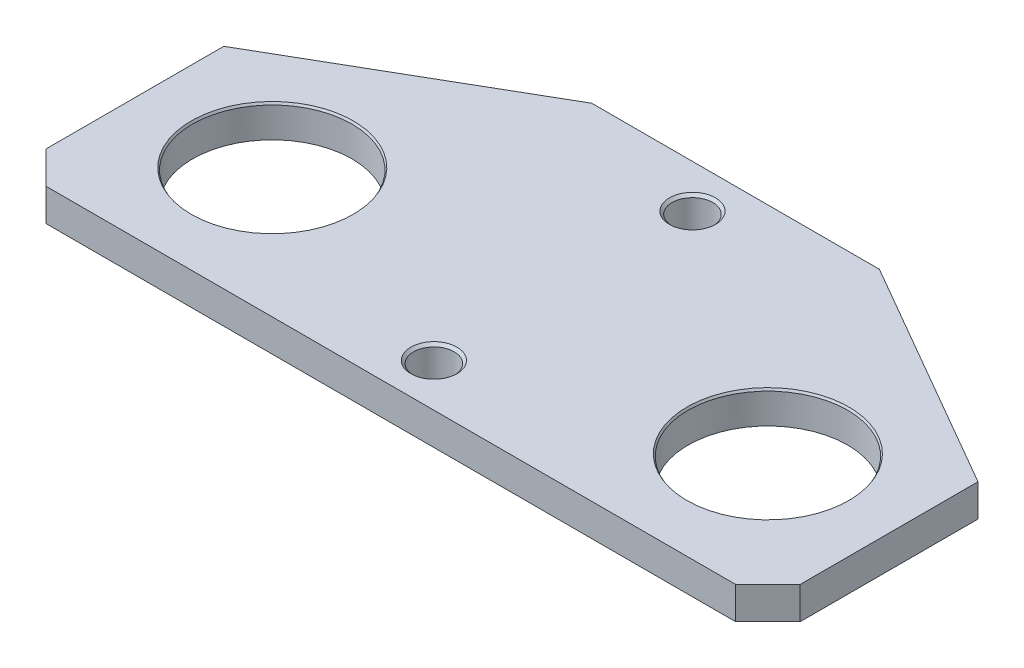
ISO-10303-21;
HEADER;
FILE_DESCRIPTION(('STEP AP214'),'2;1');
FILE_NAME('part.step','',(''),(''),'','','');
FILE_SCHEMA(('AUTOMOTIVE_DESIGN { 1 0 10303 214 1 1 1 1 }'));
ENDSEC;
DATA;
#1=APPLICATION_CONTEXT('core data for automotive mechanical design processes');
#2=APPLICATION_PROTOCOL_DEFINITION('international standard','automotive_design',2000,#1);
#3=PRODUCT_CONTEXT('',#1,'mechanical');
#4=PRODUCT('Part','Part','',(#3));
#5=PRODUCT_RELATED_PRODUCT_CATEGORY('part','',(#4));
#6=PRODUCT_DEFINITION_FORMATION('','',#4);
#7=PRODUCT_DEFINITION_CONTEXT('part definition',#1,'design');
#8=PRODUCT_DEFINITION('design','',#6,#7);
#9=PRODUCT_DEFINITION_SHAPE('','',#8);
#10=(LENGTH_UNIT() NAMED_UNIT(*) SI_UNIT(.MILLI.,.METRE.));
#11=(NAMED_UNIT(*) PLANE_ANGLE_UNIT() SI_UNIT($,.RADIAN.));
#12=(NAMED_UNIT(*) SI_UNIT($,.STERADIAN.) SOLID_ANGLE_UNIT());
#13=UNCERTAINTY_MEASURE_WITH_UNIT(LENGTH_MEASURE(1.E-05),#10,'distance_accuracy_value','');
#14=(GEOMETRIC_REPRESENTATION_CONTEXT(3) GLOBAL_UNCERTAINTY_ASSIGNED_CONTEXT((#13)) GLOBAL_UNIT_ASSIGNED_CONTEXT((#10,
#11,#12)) REPRESENTATION_CONTEXT('',''));
#15=CARTESIAN_POINT('',(0.,0.,0.));
#16=DIRECTION('',(0.,0.,1.));
#17=DIRECTION('',(1.,0.,0.));
#18=AXIS2_PLACEMENT_3D('',#15,#16,#17);
#19=CARTESIAN_POINT('',(0.,4.7625,0.));
#20=DIRECTION('',(0.,1.,0.));
#21=DIRECTION('',(0.,0.,1.));
#22=AXIS2_PLACEMENT_3D('',#19,#20,#21);
#23=PLANE('',#22);
#24=CARTESIAN_POINT('',(0.,4.7625,76.2));
#25=DIRECTION('',(0.,1.,0.));
#26=DIRECTION('',(0.,0.,1.));
#27=AXIS2_PLACEMENT_3D('',#24,#25,#26);
#28=CIRCLE('',#27,6.79375000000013);
#29=CARTESIAN_POINT('',(0.,4.7625,82.9937500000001));
#30=VERTEX_POINT('',#29);
#31=EDGE_CURVE('E41',#30,#30,#28,.F.);
#32=ORIENTED_EDGE('',*,*,#31,.T.);
#33=EDGE_LOOP('',(#32));
#34=FACE_BOUND('',#33,.T.);
#35=CARTESIAN_POINT('',(0.,4.7625,0.));
#36=DIRECTION('',(0.,1.,0.));
#37=DIRECTION('',(0.,0.,1.));
#38=AXIS2_PLACEMENT_3D('',#35,#36,#37);
#39=CIRCLE('',#38,6.7937500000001);
#40=CARTESIAN_POINT('',(0.,4.7625,6.7937500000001));
#41=VERTEX_POINT('',#40);
#42=EDGE_CURVE('E176',#41,#41,#39,.F.);
#43=ORIENTED_EDGE('',*,*,#42,.T.);
#44=EDGE_LOOP('',(#43));
#45=FACE_BOUND('',#44,.T.);
#46=CARTESIAN_POINT('',(73.025,4.7625,50.8));
#47=DIRECTION('',(0.,1.,0.));
#48=DIRECTION('',(0.,0.,1.));
#49=AXIS2_PLACEMENT_3D('',#46,#47,#48);
#50=CIRCLE('',#49,23.8666174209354);
#51=CARTESIAN_POINT('',(73.025,4.7625,74.6666174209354));
#52=VERTEX_POINT('',#51);
#53=EDGE_CURVE('E152',#52,#52,#50,.F.);
#54=ORIENTED_EDGE('',*,*,#53,.T.);
#55=EDGE_LOOP('',(#54));
#56=FACE_BOUND('',#55,.T.);
#57=CARTESIAN_POINT('',(-73.025,4.7625,50.8));
#58=DIRECTION('',(0.,1.,0.));
#59=DIRECTION('',(0.,0.,1.));
#60=AXIS2_PLACEMENT_3D('',#57,#58,#59);
#61=CIRCLE('',#60,23.8666174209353);
#62=CARTESIAN_POINT('',(-73.025,4.7625,74.6666174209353));
#63=VERTEX_POINT('',#62);
#64=EDGE_CURVE('E149',#63,#63,#61,.F.);
#65=ORIENTED_EDGE('',*,*,#64,.T.);
#66=EDGE_LOOP('',(#65));
#67=FACE_BOUND('',#66,.T.);
#68=DIRECTION('',(-1.,0.,0.));
#69=VECTOR('',#68,1.);
#70=CARTESIAN_POINT('',(-111.125,4.7625,-12.7));
#71=LINE('',#70,#69);
#72=CARTESIAN_POINT('',(42.3842335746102,4.7625,-12.7));
#73=VERTEX_POINT('',#72);
#74=CARTESIAN_POINT('',(-42.3842335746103,4.7625,-12.7));
#75=VERTEX_POINT('',#74);
#76=EDGE_CURVE('E118',#73,#75,#71,.T.);
#77=ORIENTED_EDGE('',*,*,#76,.T.);
#78=DIRECTION('',(0.866025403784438,0.,-0.500000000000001));
#79=VECTOR('',#78,1.);
#80=CARTESIAN_POINT('',(-16.0953197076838,4.7625,-27.8779114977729));
#81=LINE('',#80,#79);
#82=CARTESIAN_POINT('',(-111.125,4.7625,26.9875));
#83=VERTEX_POINT('',#82);
#84=EDGE_CURVE('E170',#75,#83,#81,.F.);
#85=ORIENTED_EDGE('',*,*,#84,.T.);
#86=DIRECTION('',(0.,0.,1.));
#87=VECTOR('',#86,1.);
#88=CARTESIAN_POINT('',(-111.125,4.7625,-12.7));
#89=LINE('',#88,#87);
#90=CARTESIAN_POINT('',(-111.125,4.7625,79.375));
#91=VERTEX_POINT('',#90);
#92=EDGE_CURVE('E128',#83,#91,#89,.T.);
#93=ORIENTED_EDGE('',*,*,#92,.T.);
#94=DIRECTION('',(-0.707106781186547,0.,-0.707106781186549));
#95=VECTOR('',#94,1.);
#96=CARTESIAN_POINT('',(-95.2500000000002,4.7625,95.2499999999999));
#97=LINE('',#96,#95);
#98=CARTESIAN_POINT('',(-101.6,4.7625,88.9));
#99=VERTEX_POINT('',#98);
#100=EDGE_CURVE('E139',#91,#99,#97,.F.);
#101=ORIENTED_EDGE('',*,*,#100,.T.);
#102=DIRECTION('',(1.,0.,0.));
#103=VECTOR('',#102,1.);
#104=CARTESIAN_POINT('',(-111.125,4.7625,88.9));
#105=LINE('',#104,#103);
#106=CARTESIAN_POINT('',(101.6,4.7625,88.9));
#107=VERTEX_POINT('',#106);
#108=EDGE_CURVE('E210',#99,#107,#105,.T.);
#109=ORIENTED_EDGE('',*,*,#108,.T.);
#110=DIRECTION('',(-0.707106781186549,0.,0.707106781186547));
#111=VECTOR('',#110,1.);
#112=CARTESIAN_POINT('',(95.2499999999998,4.7625,95.2500000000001));
#113=LINE('',#112,#111);
#114=CARTESIAN_POINT('',(111.125,4.7625,79.3749999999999));
#115=VERTEX_POINT('',#114);
#116=EDGE_CURVE('E141',#107,#115,#113,.F.);
#117=ORIENTED_EDGE('',*,*,#116,.T.);
#118=DIRECTION('',(0.,0.,-1.));
#119=VECTOR('',#118,1.);
#120=CARTESIAN_POINT('',(111.125,4.7625,-12.7));
#121=LINE('',#120,#119);
#122=CARTESIAN_POINT('',(111.125,4.7625,26.9875));
#123=VERTEX_POINT('',#122);
#124=EDGE_CURVE('E117',#115,#123,#121,.T.);
#125=ORIENTED_EDGE('',*,*,#124,.T.);
#126=DIRECTION('',(0.866025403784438,0.,0.500000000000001));
#127=VECTOR('',#126,1.);
#128=CARTESIAN_POINT('',(16.0953197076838,4.7625,-27.8779114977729));
#129=LINE('',#128,#127);
#130=EDGE_CURVE('E168',#123,#73,#129,.F.);
#131=ORIENTED_EDGE('',*,*,#130,.T.);
#132=EDGE_LOOP('',(#77,#85,#93,#101,#109,#117,#125,#131));
#133=FACE_BOUND('',#132,.T.);
#134=ADVANCED_FACE('F33',(#34,#45,#56,#67,#133),#23,.T.);
#135=CARTESIAN_POINT('',(0.,-4.7625,0.));
#136=DIRECTION('',(0.,1.,0.));
#137=DIRECTION('',(0.,0.,1.));
#138=AXIS2_PLACEMENT_3D('',#135,#136,#137);
#139=PLANE('',#138);
#140=CARTESIAN_POINT('',(0.,-4.7625,0.));
#141=DIRECTION('',(0.,1.,0.));
#142=DIRECTION('',(0.,0.,1.));
#143=AXIS2_PLACEMENT_3D('',#140,#141,#142);
#144=CIRCLE('',#143,6.);
#145=CARTESIAN_POINT('',(0.,-4.7625,-6.));
#146=VERTEX_POINT('',#145);
#147=EDGE_CURVE('E198',#146,#146,#144,.T.);
#148=ORIENTED_EDGE('',*,*,#147,.T.);
#149=EDGE_LOOP('',(#148));
#150=FACE_BOUND('',#149,.T.);
#151=CARTESIAN_POINT('',(-73.025,-4.7625,50.8));
#152=DIRECTION('',(0.,1.,0.));
#153=DIRECTION('',(0.,0.,1.));
#154=AXIS2_PLACEMENT_3D('',#151,#152,#153);
#155=CIRCLE('',#154,23.5);
#156=CARTESIAN_POINT('',(-73.025,-4.7625,27.3));
#157=VERTEX_POINT('',#156);
#158=EDGE_CURVE('E206',#157,#157,#155,.T.);
#159=ORIENTED_EDGE('',*,*,#158,.T.);
#160=EDGE_LOOP('',(#159));
#161=FACE_BOUND('',#160,.T.);
#162=DIRECTION('',(0.,0.,1.));
#163=VECTOR('',#162,1.);
#164=CARTESIAN_POINT('',(-111.125,-4.7625,-12.7));
#165=LINE('',#164,#163);
#166=CARTESIAN_POINT('',(-111.125,-4.7625,26.9875));
#167=VERTEX_POINT('',#166);
#168=CARTESIAN_POINT('',(-111.125,-4.7625,79.375));
#169=VERTEX_POINT('',#168);
#170=EDGE_CURVE('E130',#167,#169,#165,.T.);
#171=ORIENTED_EDGE('',*,*,#170,.F.);
#172=DIRECTION('',(-0.866025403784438,0.,0.500000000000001));
#173=VECTOR('',#172,1.);
#174=CARTESIAN_POINT('',(-111.125,-4.7625,26.9875));
#175=LINE('',#174,#173);
#176=CARTESIAN_POINT('',(-42.3842335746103,-4.7625,-12.7));
#177=VERTEX_POINT('',#176);
#178=EDGE_CURVE('E162',#167,#177,#175,.F.);
#179=ORIENTED_EDGE('',*,*,#178,.T.);
#180=DIRECTION('',(-1.,0.,0.));
#181=VECTOR('',#180,1.);
#182=CARTESIAN_POINT('',(-111.125,-4.7625,-12.7));
#183=LINE('',#182,#181);
#184=CARTESIAN_POINT('',(42.3842335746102,-4.7625,-12.7));
#185=VERTEX_POINT('',#184);
#186=EDGE_CURVE('E125',#185,#177,#183,.T.);
#187=ORIENTED_EDGE('',*,*,#186,.F.);
#188=DIRECTION('',(-0.866025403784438,0.,-0.500000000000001));
#189=VECTOR('',#188,1.);
#190=CARTESIAN_POINT('',(42.3842335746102,-4.7625,-12.7));
#191=LINE('',#190,#189);
#192=CARTESIAN_POINT('',(111.125,-4.7625,26.9875));
#193=VERTEX_POINT('',#192);
#194=EDGE_CURVE('E124',#185,#193,#191,.F.);
#195=ORIENTED_EDGE('',*,*,#194,.T.);
#196=DIRECTION('',(0.,0.,-1.));
#197=VECTOR('',#196,1.);
#198=CARTESIAN_POINT('',(111.125,-4.7625,-12.7));
#199=LINE('',#198,#197);
#200=CARTESIAN_POINT('',(111.125,-4.7625,79.3749999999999));
#201=VERTEX_POINT('',#200);
#202=EDGE_CURVE('E116',#201,#193,#199,.T.);
#203=ORIENTED_EDGE('',*,*,#202,.F.);
#204=DIRECTION('',(0.707106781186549,0.,-0.707106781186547));
#205=VECTOR('',#204,1.);
#206=CARTESIAN_POINT('',(111.125,-4.7625,79.375));
#207=LINE('',#206,#205);
#208=CARTESIAN_POINT('',(101.6,-4.7625,88.9));
#209=VERTEX_POINT('',#208);
#210=EDGE_CURVE('E102',#201,#209,#207,.F.);
#211=ORIENTED_EDGE('',*,*,#210,.T.);
#212=DIRECTION('',(1.,0.,0.));
#213=VECTOR('',#212,1.);
#214=CARTESIAN_POINT('',(-111.125,-4.7625,88.9));
#215=LINE('',#214,#213);
#216=CARTESIAN_POINT('',(-101.6,-4.7625,88.9));
#217=VERTEX_POINT('',#216);
#218=EDGE_CURVE('E126',#217,#209,#215,.T.);
#219=ORIENTED_EDGE('',*,*,#218,.F.);
#220=DIRECTION('',(0.707106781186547,0.,0.707106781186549));
#221=VECTOR('',#220,1.);
#222=CARTESIAN_POINT('',(-101.6,-4.7625,88.9));
#223=LINE('',#222,#221);
#224=EDGE_CURVE('E113',#217,#169,#223,.F.);
#225=ORIENTED_EDGE('',*,*,#224,.T.);
#226=EDGE_LOOP('',(#171,#179,#187,#195,#203,#211,#219,#225));
#227=FACE_BOUND('',#226,.T.);
#228=CARTESIAN_POINT('',(73.025,-4.7625,50.8));
#229=DIRECTION('',(0.,1.,0.));
#230=DIRECTION('',(0.,0.,1.));
#231=AXIS2_PLACEMENT_3D('',#228,#229,#230);
#232=CIRCLE('',#231,23.5);
#233=CARTESIAN_POINT('',(73.025,-4.7625,27.3));
#234=VERTEX_POINT('',#233);
#235=EDGE_CURVE('E201',#234,#234,#232,.T.);
#236=ORIENTED_EDGE('',*,*,#235,.T.);
#237=EDGE_LOOP('',(#236));
#238=FACE_BOUND('',#237,.T.);
#239=CARTESIAN_POINT('',(0.,-4.7625,76.2));
#240=DIRECTION('',(0.,1.,0.));
#241=DIRECTION('',(0.,0.,1.));
#242=AXIS2_PLACEMENT_3D('',#239,#240,#241);
#243=CIRCLE('',#242,6.00000000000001);
#244=CARTESIAN_POINT('',(0.,-4.7625,70.2));
#245=VERTEX_POINT('',#244);
#246=EDGE_CURVE('E196',#245,#245,#243,.T.);
#247=ORIENTED_EDGE('',*,*,#246,.T.);
#248=EDGE_LOOP('',(#247));
#249=FACE_BOUND('',#248,.T.);
#250=ADVANCED_FACE('F121',(#150,#161,#227,#238,#249),#139,.F.);
#251=CARTESIAN_POINT('',(-111.125,4.7625,-12.7));
#252=DIRECTION('',(1.,0.,0.));
#253=DIRECTION('',(0.,0.,-1.));
#254=AXIS2_PLACEMENT_3D('',#251,#252,#253);
#255=PLANE('',#254);
#256=ORIENTED_EDGE('',*,*,#92,.F.);
#257=DIRECTION('',(0.,-1.,0.));
#258=VECTOR('',#257,1.);
#259=CARTESIAN_POINT('',(-111.125,4.7625,26.9875));
#260=LINE('',#259,#258);
#261=EDGE_CURVE('E158',#83,#167,#260,.T.);
#262=ORIENTED_EDGE('',*,*,#261,.T.);
#263=ORIENTED_EDGE('',*,*,#170,.T.);
#264=DIRECTION('',(0.,1.,0.));
#265=VECTOR('',#264,1.);
#266=CARTESIAN_POINT('',(-111.125,4.7625,79.375));
#267=LINE('',#266,#265);
#268=EDGE_CURVE('E143',#169,#91,#267,.T.);
#269=ORIENTED_EDGE('',*,*,#268,.T.);
#270=EDGE_LOOP('',(#256,#262,#263,#269));
#271=FACE_BOUND('',#270,.T.);
#272=ADVANCED_FACE('F216',(#271),#255,.F.);
#273=CARTESIAN_POINT('',(-111.125,4.7625,88.9));
#274=DIRECTION('',(0.,0.,-1.));
#275=DIRECTION('',(-1.,0.,0.));
#276=AXIS2_PLACEMENT_3D('',#273,#274,#275);
#277=PLANE('',#276);
#278=ORIENTED_EDGE('',*,*,#218,.T.);
#279=DIRECTION('',(0.,1.,0.));
#280=VECTOR('',#279,1.);
#281=CARTESIAN_POINT('',(101.6,4.7625,88.9));
#282=LINE('',#281,#280);
#283=EDGE_CURVE('E107',#209,#107,#282,.T.);
#284=ORIENTED_EDGE('',*,*,#283,.T.);
#285=ORIENTED_EDGE('',*,*,#108,.F.);
#286=DIRECTION('',(0.,-1.,0.));
#287=VECTOR('',#286,1.);
#288=CARTESIAN_POINT('',(-101.6,4.7625,88.9));
#289=LINE('',#288,#287);
#290=EDGE_CURVE('E112',#99,#217,#289,.T.);
#291=ORIENTED_EDGE('',*,*,#290,.T.);
#292=EDGE_LOOP('',(#278,#284,#285,#291));
#293=FACE_BOUND('',#292,.T.);
#294=ADVANCED_FACE('F226',(#293),#277,.F.);
#295=CARTESIAN_POINT('',(111.125,4.7625,-12.7));
#296=DIRECTION('',(-1.,0.,0.));
#297=DIRECTION('',(0.,0.,1.));
#298=AXIS2_PLACEMENT_3D('',#295,#296,#297);
#299=PLANE('',#298);
#300=ORIENTED_EDGE('',*,*,#202,.T.);
#301=DIRECTION('',(0.,1.,0.));
#302=VECTOR('',#301,1.);
#303=CARTESIAN_POINT('',(111.125,4.7625,26.9875));
#304=LINE('',#303,#302);
#305=EDGE_CURVE('E48',#193,#123,#304,.T.);
#306=ORIENTED_EDGE('',*,*,#305,.T.);
#307=ORIENTED_EDGE('',*,*,#124,.F.);
#308=DIRECTION('',(0.,-1.,0.));
#309=VECTOR('',#308,1.);
#310=CARTESIAN_POINT('',(111.125,4.7625,79.375));
#311=LINE('',#310,#309);
#312=EDGE_CURVE('E106',#115,#201,#311,.T.);
#313=ORIENTED_EDGE('',*,*,#312,.T.);
#314=EDGE_LOOP('',(#300,#306,#307,#313));
#315=FACE_BOUND('',#314,.T.);
#316=ADVANCED_FACE('F115',(#315),#299,.F.);
#317=CARTESIAN_POINT('',(-111.125,4.7625,-12.7));
#318=DIRECTION('',(0.,0.,1.));
#319=DIRECTION('',(1.,0.,0.));
#320=AXIS2_PLACEMENT_3D('',#317,#318,#319);
#321=PLANE('',#320);
#322=ORIENTED_EDGE('',*,*,#186,.T.);
#323=DIRECTION('',(0.,1.,0.));
#324=VECTOR('',#323,1.);
#325=CARTESIAN_POINT('',(-42.3842335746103,4.7625,-12.7));
#326=LINE('',#325,#324);
#327=EDGE_CURVE('E56',#177,#75,#326,.T.);
#328=ORIENTED_EDGE('',*,*,#327,.T.);
#329=ORIENTED_EDGE('',*,*,#76,.F.);
#330=DIRECTION('',(0.,-1.,0.));
#331=VECTOR('',#330,1.);
#332=CARTESIAN_POINT('',(42.3842335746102,4.7625,-12.7));
#333=LINE('',#332,#331);
#334=EDGE_CURVE('E164',#73,#185,#333,.T.);
#335=ORIENTED_EDGE('',*,*,#334,.T.);
#336=EDGE_LOOP('',(#322,#328,#329,#335));
#337=FACE_BOUND('',#336,.T.);
#338=ADVANCED_FACE('F233',(#337),#321,.F.);
#339=CARTESIAN_POINT('',(-73.025,4.7625,50.8));
#340=DIRECTION('',(0.,-1.,0.));
#341=DIRECTION('',(0.,0.,-1.));
#342=AXIS2_PLACEMENT_3D('',#339,#340,#341);
#343=CYLINDRICAL_SURFACE('',#342,23.5);
#344=CARTESIAN_POINT('',(-73.025,4.12750000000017,50.8));
#345=DIRECTION('',(0.,1.,0.));
#346=DIRECTION('',(0.,0.,1.));
#347=AXIS2_PLACEMENT_3D('',#344,#345,#346);
#348=CIRCLE('',#347,23.5);
#349=CARTESIAN_POINT('',(-73.025,4.12750000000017,27.3));
#350=VERTEX_POINT('',#349);
#351=EDGE_CURVE('E155',#350,#350,#348,.T.);
#352=CARTESIAN_POINT('',(-73.025,4.12750000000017,27.3));
#353=CARTESIAN_POINT('',(-73.025,4.0348958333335,27.3));
#354=CARTESIAN_POINT('',(-73.025,3.94229166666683,27.3));
#355=CARTESIAN_POINT('',(-73.025,3.7570833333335,27.3));
#356=CARTESIAN_POINT('',(-73.025,3.66447916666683,27.3));
#357=CARTESIAN_POINT('',(-73.025,3.47927083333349,27.3));
#358=CARTESIAN_POINT('',(-73.025,3.38666666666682,27.3));
#359=CARTESIAN_POINT('',(-73.025,3.20145833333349,27.3));
#360=CARTESIAN_POINT('',(-73.025,3.10885416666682,27.3));
#361=CARTESIAN_POINT('',(-73.025,2.92364583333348,27.3));
#362=CARTESIAN_POINT('',(-73.025,2.83104166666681,27.3));
#363=CARTESIAN_POINT('',(-73.025,2.64583333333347,27.3));
#364=CARTESIAN_POINT('',(-73.025,2.55322916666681,27.3));
#365=CARTESIAN_POINT('',(-73.025,2.36802083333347,27.3));
#366=CARTESIAN_POINT('',(-73.025,2.2754166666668,27.3));
#367=CARTESIAN_POINT('',(-73.025,2.09020833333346,27.3));
#368=CARTESIAN_POINT('',(-73.025,1.9976041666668,27.3));
#369=CARTESIAN_POINT('',(-73.025,1.81239583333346,27.3));
#370=CARTESIAN_POINT('',(-73.025,1.71979166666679,27.3));
#371=CARTESIAN_POINT('',(-73.025,1.53458333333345,27.3));
#372=CARTESIAN_POINT('',(-73.025,1.44197916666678,27.3));
#373=CARTESIAN_POINT('',(-73.025,1.25677083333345,27.3));
#374=CARTESIAN_POINT('',(-73.025,1.16416666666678,27.3));
#375=CARTESIAN_POINT('',(-73.025,0.978958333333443,27.3));
#376=CARTESIAN_POINT('',(-73.025,0.886354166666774,27.3));
#377=CARTESIAN_POINT('',(-73.025,0.701145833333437,27.3));
#378=CARTESIAN_POINT('',(-73.025,0.608541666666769,27.3));
#379=CARTESIAN_POINT('',(-73.025,0.423333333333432,27.3));
#380=CARTESIAN_POINT('',(-73.025,0.330729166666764,27.3));
#381=CARTESIAN_POINT('',(-73.025,0.145520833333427,27.3));
#382=CARTESIAN_POINT('',(-73.025,0.0529166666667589,27.3));
#383=CARTESIAN_POINT('',(-73.025,-0.132291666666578,27.3));
#384=CARTESIAN_POINT('',(-73.025,-0.224895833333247,27.3));
#385=CARTESIAN_POINT('',(-73.025,-0.410104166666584,27.3));
#386=CARTESIAN_POINT('',(-73.025,-0.502708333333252,27.3));
#387=CARTESIAN_POINT('',(-73.025,-0.687916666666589,27.3));
#388=CARTESIAN_POINT('',(-73.025,-0.780520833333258,27.3));
#389=CARTESIAN_POINT('',(-73.025,-0.965729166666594,27.3));
#390=CARTESIAN_POINT('',(-73.025,-1.05833333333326,27.3));
#391=CARTESIAN_POINT('',(-73.025,-1.2435416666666,27.3));
#392=CARTESIAN_POINT('',(-73.025,-1.33614583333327,27.3));
#393=CARTESIAN_POINT('',(-73.025,-1.52135416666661,27.3));
#394=CARTESIAN_POINT('',(-73.025,-1.61395833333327,27.3));
#395=CARTESIAN_POINT('',(-73.025,-1.79916666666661,27.3));
#396=CARTESIAN_POINT('',(-73.025,-1.89177083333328,27.3));
#397=CARTESIAN_POINT('',(-73.025,-2.07697916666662,27.3));
#398=CARTESIAN_POINT('',(-73.025,-2.16958333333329,27.3));
#399=CARTESIAN_POINT('',(-73.025,-2.35479166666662,27.3));
#400=CARTESIAN_POINT('',(-73.025,-2.44739583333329,27.3));
#401=CARTESIAN_POINT('',(-73.025,-2.63260416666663,27.3));
#402=CARTESIAN_POINT('',(-73.025,-2.7252083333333,27.3));
#403=CARTESIAN_POINT('',(-73.025,-2.91041666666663,27.3));
#404=CARTESIAN_POINT('',(-73.025,-3.0030208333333,27.3));
#405=CARTESIAN_POINT('',(-73.025,-3.18822916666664,27.3));
#406=CARTESIAN_POINT('',(-73.025,-3.28083333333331,27.3));
#407=CARTESIAN_POINT('',(-73.025,-3.46604166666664,27.3));
#408=CARTESIAN_POINT('',(-73.025,-3.55864583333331,27.3));
#409=CARTESIAN_POINT('',(-73.025,-3.74385416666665,27.3));
#410=CARTESIAN_POINT('',(-73.025,-3.83645833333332,27.3));
#411=CARTESIAN_POINT('',(-73.025,-4.02166666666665,27.3));
#412=CARTESIAN_POINT('',(-73.025,-4.11427083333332,27.3));
#413=CARTESIAN_POINT('',(-73.025,-4.29947916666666,27.3));
#414=CARTESIAN_POINT('',(-73.025,-4.39208333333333,27.3));
#415=CARTESIAN_POINT('',(-73.025,-4.57729166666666,27.3));
#416=CARTESIAN_POINT('',(-73.025,-4.66989583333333,27.3));
#417=CARTESIAN_POINT('',(-73.025,-4.7625,27.3));
#418=B_SPLINE_CURVE_WITH_KNOTS('',3,(#352,#353,#354,#355,#356,#357,#358,#359,#360,#361,#362,
#363,#364,#365,#366,#367,#368,#369,#370,#371,#372,#373,#374,#375,#376,#377,#378,#379,#380,#381,
#382,#383,#384,#385,#386,#387,#388,#389,#390,#391,#392,#393,#394,#395,#396,#397,#398,#399,#400,
#401,#402,#403,#404,#405,#406,#407,#408,#409,#410,#411,#412,#413,#414,#415,#416,#417),
.UNSPECIFIED.,.F.,.F.,(4,2,2,2,2,2,2,2,2,2,2,2,2,2,2,2,2,2,2,2,2,2,2,2,2,2,2,2,2,2,2,2,4),(0.,
0.277812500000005,0.555625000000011,0.833437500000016,1.11125000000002,1.38906250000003,
1.66687500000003,1.94468750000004,2.22250000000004,2.50031250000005,2.77812500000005,
3.05593750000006,3.33375000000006,3.61156250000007,3.88937500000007,4.16718750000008,
4.44500000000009,4.72281250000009,5.0006250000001,5.2784375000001,5.55625000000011,
5.83406250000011,6.11187500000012,6.38968750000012,6.66750000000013,6.94531250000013,
7.22312500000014,7.50093750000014,7.77875000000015,8.05656250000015,8.33437500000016,
8.61218750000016,8.89000000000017),.UNSPECIFIED.);
#419=EDGE_CURVE('BSEAM244',#350,#157,#418,.T.);
#420=ORIENTED_EDGE('',*,*,#351,.T.);
#421=ORIENTED_EDGE('',*,*,#158,.F.);
#422=ORIENTED_EDGE('',*,*,#419,.T.);
#423=ORIENTED_EDGE('',*,*,#419,.F.);
#424=EDGE_LOOP('',(#420,#422,#421,#423));
#425=FACE_BOUND('',#424,.T.);
#426=ADVANCED_FACE('F244',(#425),#343,.F.);
#427=CARTESIAN_POINT('',(73.025,4.7625,50.8));
#428=DIRECTION('',(0.,-1.,0.));
#429=DIRECTION('',(0.,0.,-1.));
#430=AXIS2_PLACEMENT_3D('',#427,#428,#429);
#431=CYLINDRICAL_SURFACE('',#430,23.5);
#432=CARTESIAN_POINT('',(73.025,4.12750000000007,50.8));
#433=DIRECTION('',(0.,1.,0.));
#434=DIRECTION('',(0.,0.,1.));
#435=AXIS2_PLACEMENT_3D('',#432,#433,#434);
#436=CIRCLE('',#435,23.5);
#437=CARTESIAN_POINT('',(73.025,4.12750000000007,27.3));
#438=VERTEX_POINT('',#437);
#439=EDGE_CURVE('E146',#438,#438,#436,.T.);
#440=CARTESIAN_POINT('',(73.025,4.12750000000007,27.3));
#441=CARTESIAN_POINT('',(73.025,4.0348958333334,27.3));
#442=CARTESIAN_POINT('',(73.025,3.94229166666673,27.3));
#443=CARTESIAN_POINT('',(73.025,3.7570833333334,27.3));
#444=CARTESIAN_POINT('',(73.025,3.66447916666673,27.3));
#445=CARTESIAN_POINT('',(73.025,3.47927083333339,27.3));
#446=CARTESIAN_POINT('',(73.025,3.38666666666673,27.3));
#447=CARTESIAN_POINT('',(73.025,3.20145833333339,27.3));
#448=CARTESIAN_POINT('',(73.025,3.10885416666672,27.3));
#449=CARTESIAN_POINT('',(73.025,2.92364583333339,27.3));
#450=CARTESIAN_POINT('',(73.025,2.83104166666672,27.3));
#451=CARTESIAN_POINT('',(73.025,2.64583333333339,27.3));
#452=CARTESIAN_POINT('',(73.025,2.55322916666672,27.3));
#453=CARTESIAN_POINT('',(73.025,2.36802083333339,27.3));
#454=CARTESIAN_POINT('',(73.025,2.27541666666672,27.3));
#455=CARTESIAN_POINT('',(73.025,2.09020833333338,27.3));
#456=CARTESIAN_POINT('',(73.025,1.99760416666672,27.3));
#457=CARTESIAN_POINT('',(73.025,1.81239583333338,27.3));
#458=CARTESIAN_POINT('',(73.025,1.71979166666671,27.3));
#459=CARTESIAN_POINT('',(73.025,1.53458333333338,27.3));
#460=CARTESIAN_POINT('',(73.025,1.44197916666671,27.3));
#461=CARTESIAN_POINT('',(73.025,1.25677083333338,27.3));
#462=CARTESIAN_POINT('',(73.025,1.16416666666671,27.3));
#463=CARTESIAN_POINT('',(73.025,0.978958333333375,27.3));
#464=CARTESIAN_POINT('',(73.025,0.886354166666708,27.3));
#465=CARTESIAN_POINT('',(73.025,0.701145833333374,27.3));
#466=CARTESIAN_POINT('',(73.025,0.608541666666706,27.3));
#467=CARTESIAN_POINT('',(73.025,0.423333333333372,27.3));
#468=CARTESIAN_POINT('',(73.025,0.330729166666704,27.3));
#469=CARTESIAN_POINT('',(73.025,0.14552083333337,27.3));
#470=CARTESIAN_POINT('',(73.025,0.0529166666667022,27.3));
#471=CARTESIAN_POINT('',(73.025,-0.132291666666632,27.3));
#472=CARTESIAN_POINT('',(73.025,-0.2248958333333,27.3));
#473=CARTESIAN_POINT('',(73.025,-0.410104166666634,27.3));
#474=CARTESIAN_POINT('',(73.025,-0.502708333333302,27.3));
#475=CARTESIAN_POINT('',(73.025,-0.687916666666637,27.3));
#476=CARTESIAN_POINT('',(73.025,-0.780520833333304,27.3));
#477=CARTESIAN_POINT('',(73.025,-0.965729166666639,27.3));
#478=CARTESIAN_POINT('',(73.025,-1.05833333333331,27.3));
#479=CARTESIAN_POINT('',(73.025,-1.24354166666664,27.3));
#480=CARTESIAN_POINT('',(73.025,-1.33614583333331,27.3));
#481=CARTESIAN_POINT('',(73.025,-1.52135416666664,27.3));
#482=CARTESIAN_POINT('',(73.025,-1.61395833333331,27.3));
#483=CARTESIAN_POINT('',(73.025,-1.79916666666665,27.3));
#484=CARTESIAN_POINT('',(73.025,-1.89177083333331,27.3));
#485=CARTESIAN_POINT('',(73.025,-2.07697916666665,27.3));
#486=CARTESIAN_POINT('',(73.025,-2.16958333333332,27.3));
#487=CARTESIAN_POINT('',(73.025,-2.35479166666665,27.3));
#488=CARTESIAN_POINT('',(73.025,-2.44739583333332,27.3));
#489=CARTESIAN_POINT('',(73.025,-2.63260416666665,27.3));
#490=CARTESIAN_POINT('',(73.025,-2.72520833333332,27.3));
#491=CARTESIAN_POINT('',(73.025,-2.91041666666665,27.3));
#492=CARTESIAN_POINT('',(73.025,-3.00302083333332,27.3));
#493=CARTESIAN_POINT('',(73.025,-3.18822916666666,27.3));
#494=CARTESIAN_POINT('',(73.025,-3.28083333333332,27.3));
#495=CARTESIAN_POINT('',(73.025,-3.46604166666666,27.3));
#496=CARTESIAN_POINT('',(73.025,-3.55864583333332,27.3));
#497=CARTESIAN_POINT('',(73.025,-3.74385416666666,27.3));
#498=CARTESIAN_POINT('',(73.025,-3.83645833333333,27.3));
#499=CARTESIAN_POINT('',(73.025,-4.02166666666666,27.3));
#500=CARTESIAN_POINT('',(73.025,-4.11427083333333,27.3));
#501=CARTESIAN_POINT('',(73.025,-4.29947916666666,27.3));
#502=CARTESIAN_POINT('',(73.025,-4.39208333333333,27.3));
#503=CARTESIAN_POINT('',(73.025,-4.57729166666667,27.3));
#504=CARTESIAN_POINT('',(73.025,-4.66989583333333,27.3));
#505=CARTESIAN_POINT('',(73.025,-4.7625,27.3));
#506=B_SPLINE_CURVE_WITH_KNOTS('',3,(#440,#441,#442,#443,#444,#445,#446,#447,#448,#449,#450,
#451,#452,#453,#454,#455,#456,#457,#458,#459,#460,#461,#462,#463,#464,#465,#466,#467,#468,#469,
#470,#471,#472,#473,#474,#475,#476,#477,#478,#479,#480,#481,#482,#483,#484,#485,#486,#487,#488,
#489,#490,#491,#492,#493,#494,#495,#496,#497,#498,#499,#500,#501,#502,#503,#504,#505),
.UNSPECIFIED.,.F.,.F.,(4,2,2,2,2,2,2,2,2,2,2,2,2,2,2,2,2,2,2,2,2,2,2,2,2,2,2,2,2,2,2,2,4),(0.,
0.277812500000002,0.555625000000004,0.833437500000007,1.11125000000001,1.38906250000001,
1.66687500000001,1.94468750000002,2.22250000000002,2.50031250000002,2.77812500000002,
3.05593750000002,3.33375000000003,3.61156250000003,3.88937500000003,4.16718750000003,
4.44500000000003,4.72281250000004,5.00062500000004,5.27843750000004,5.55625000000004,
5.83406250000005,6.11187500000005,6.38968750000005,6.66750000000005,6.94531250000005,
7.22312500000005,7.50093750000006,7.77875000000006,8.05656250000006,8.33437500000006,
8.61218750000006,8.89000000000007),.UNSPECIFIED.);
#507=EDGE_CURVE('BSEAM251',#438,#234,#506,.T.);
#508=ORIENTED_EDGE('',*,*,#439,.T.);
#509=ORIENTED_EDGE('',*,*,#235,.F.);
#510=ORIENTED_EDGE('',*,*,#507,.T.);
#511=ORIENTED_EDGE('',*,*,#507,.F.);
#512=EDGE_LOOP('',(#508,#510,#509,#511));
#513=FACE_BOUND('',#512,.T.);
#514=ADVANCED_FACE('F251',(#513),#431,.F.);
#515=CARTESIAN_POINT('',(0.,4.7625,0.));
#516=DIRECTION('',(0.,-1.,0.));
#517=DIRECTION('',(0.,0.,-1.));
#518=AXIS2_PLACEMENT_3D('',#515,#516,#517);
#519=CYLINDRICAL_SURFACE('',#518,6.);
#520=CARTESIAN_POINT('',(0.,3.96874999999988,0.));
#521=DIRECTION('',(0.,1.,0.));
#522=DIRECTION('',(0.,0.,1.));
#523=AXIS2_PLACEMENT_3D('',#520,#521,#522);
#524=CIRCLE('',#523,6.);
#525=CARTESIAN_POINT('',(0.,3.96874999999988,-6.));
#526=VERTEX_POINT('',#525);
#527=EDGE_CURVE('E11',#526,#526,#524,.T.);
#528=CARTESIAN_POINT('',(0.,3.96874999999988,-6.));
#529=CARTESIAN_POINT('',(0.,3.87779947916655,-6.));
#530=CARTESIAN_POINT('',(0.,3.78684895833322,-6.));
#531=CARTESIAN_POINT('',(0.,3.60494791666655,-6.));
#532=CARTESIAN_POINT('',(0.,3.51399739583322,-6.));
#533=CARTESIAN_POINT('',(0.,3.33209635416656,-6.));
#534=CARTESIAN_POINT('',(0.,3.24114583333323,-6.));
#535=CARTESIAN_POINT('',(0.,3.05924479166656,-6.));
#536=CARTESIAN_POINT('',(0.,2.96829427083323,-6.));
#537=CARTESIAN_POINT('',(0.,2.78639322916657,-6.));
#538=CARTESIAN_POINT('',(0.,2.69544270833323,-6.));
#539=CARTESIAN_POINT('',(0.,2.51354166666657,-6.));
#540=CARTESIAN_POINT('',(0.,2.42259114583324,-6.));
#541=CARTESIAN_POINT('',(0.,2.24069010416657,-6.));
#542=CARTESIAN_POINT('',(0.,2.14973958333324,-6.));
#543=CARTESIAN_POINT('',(0.,1.96783854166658,-6.));
#544=CARTESIAN_POINT('',(0.,1.87688802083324,-6.));
#545=CARTESIAN_POINT('',(0.,1.69498697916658,-6.));
#546=CARTESIAN_POINT('',(0.,1.60403645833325,-6.));
#547=CARTESIAN_POINT('',(0.,1.42213541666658,-6.));
#548=CARTESIAN_POINT('',(0.,1.33118489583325,-6.));
#549=CARTESIAN_POINT('',(0.,1.14928385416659,-6.));
#550=CARTESIAN_POINT('',(0.,1.05833333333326,-6.));
#551=CARTESIAN_POINT('',(0.,0.876432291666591,-6.));
#552=CARTESIAN_POINT('',(0.,0.785481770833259,-6.));
#553=CARTESIAN_POINT('',(0.,0.603580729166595,-6.));
#554=CARTESIAN_POINT('',(0.,0.512630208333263,-6.));
#555=CARTESIAN_POINT('',(0.,0.330729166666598,-6.));
#556=CARTESIAN_POINT('',(0.,0.239778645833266,-6.));
#557=CARTESIAN_POINT('',(0.,0.057877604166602,-6.));
#558=CARTESIAN_POINT('',(0.,-0.0330729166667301,-6.));
#559=CARTESIAN_POINT('',(0.,-0.214973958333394,-6.));
#560=CARTESIAN_POINT('',(0.,-0.305924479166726,-6.));
#561=CARTESIAN_POINT('',(0.,-0.487825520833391,-6.));
#562=CARTESIAN_POINT('',(0.,-0.578776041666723,-6.));
#563=CARTESIAN_POINT('',(0.,-0.760677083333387,-6.));
#564=CARTESIAN_POINT('',(0.,-0.851627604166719,-6.));
#565=CARTESIAN_POINT('',(0.,-1.03352864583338,-6.));
#566=CARTESIAN_POINT('',(0.,-1.12447916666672,-6.));
#567=CARTESIAN_POINT('',(0.,-1.30638020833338,-6.));
#568=CARTESIAN_POINT('',(0.,-1.39733072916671,-6.));
#569=CARTESIAN_POINT('',(0.,-1.57923177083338,-6.));
#570=CARTESIAN_POINT('',(0.,-1.67018229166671,-6.));
#571=CARTESIAN_POINT('',(0.,-1.85208333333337,-6.));
#572=CARTESIAN_POINT('',(0.,-1.9430338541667,-6.));
#573=CARTESIAN_POINT('',(0.,-2.12493489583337,-6.));
#574=CARTESIAN_POINT('',(0.,-2.2158854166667,-6.));
#575=CARTESIAN_POINT('',(0.,-2.39778645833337,-6.));
#576=CARTESIAN_POINT('',(0.,-2.4887369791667,-6.));
#577=CARTESIAN_POINT('',(0.,-2.67063802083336,-6.));
#578=CARTESIAN_POINT('',(0.,-2.76158854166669,-6.));
#579=CARTESIAN_POINT('',(0.,-2.94348958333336,-6.));
#580=CARTESIAN_POINT('',(0.,-3.03444010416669,-6.));
#581=CARTESIAN_POINT('',(0.,-3.21634114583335,-6.));
#582=CARTESIAN_POINT('',(0.,-3.30729166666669,-6.));
#583=CARTESIAN_POINT('',(0.,-3.48919270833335,-6.));
#584=CARTESIAN_POINT('',(0.,-3.58014322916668,-6.));
#585=CARTESIAN_POINT('',(0.,-3.76204427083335,-6.));
#586=CARTESIAN_POINT('',(0.,-3.85299479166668,-6.));
#587=CARTESIAN_POINT('',(0.,-4.03489583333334,-6.));
#588=CARTESIAN_POINT('',(0.,-4.12584635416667,-6.));
#589=CARTESIAN_POINT('',(0.,-4.30774739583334,-6.));
#590=CARTESIAN_POINT('',(0.,-4.39869791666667,-6.));
#591=CARTESIAN_POINT('',(0.,-4.58059895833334,-6.));
#592=CARTESIAN_POINT('',(0.,-4.67154947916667,-6.));
#593=CARTESIAN_POINT('',(0.,-4.7625,-6.));
#594=B_SPLINE_CURVE_WITH_KNOTS('',3,(#528,#529,#530,#531,#532,#533,#534,#535,#536,#537,#538,
#539,#540,#541,#542,#543,#544,#545,#546,#547,#548,#549,#550,#551,#552,#553,#554,#555,#556,#557,
#558,#559,#560,#561,#562,#563,#564,#565,#566,#567,#568,#569,#570,#571,#572,#573,#574,#575,#576,
#577,#578,#579,#580,#581,#582,#583,#584,#585,#586,#587,#588,#589,#590,#591,#592,#593),
.UNSPECIFIED.,.F.,.F.,(4,2,2,2,2,2,2,2,2,2,2,2,2,2,2,2,2,2,2,2,2,2,2,2,2,2,2,2,2,2,2,2,4),(0.,
0.272851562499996,0.545703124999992,0.818554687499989,1.09140624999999,1.36425781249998,
1.63710937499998,1.90996093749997,2.18281249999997,2.45566406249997,2.72851562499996,
3.00136718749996,3.27421874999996,3.54707031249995,3.81992187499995,4.09277343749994,
4.36562499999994,4.63847656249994,4.91132812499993,5.18417968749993,5.45703124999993,
5.72988281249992,6.00273437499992,6.27558593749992,6.54843749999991,6.82128906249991,
7.0941406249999,7.3669921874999,7.6398437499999,7.91269531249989,8.18554687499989,
8.45839843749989,8.73124999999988),.UNSPECIFIED.);
#595=EDGE_CURVE('BSEAM192',#526,#146,#594,.T.);
#596=ORIENTED_EDGE('',*,*,#527,.T.);
#597=ORIENTED_EDGE('',*,*,#147,.F.);
#598=ORIENTED_EDGE('',*,*,#595,.T.);
#599=ORIENTED_EDGE('',*,*,#595,.F.);
#600=EDGE_LOOP('',(#596,#598,#597,#599));
#601=FACE_BOUND('',#600,.T.);
#602=ADVANCED_FACE('F192',(#601),#519,.F.);
#603=CARTESIAN_POINT('',(0.,4.7625,76.2));
#604=DIRECTION('',(0.,-1.,0.));
#605=DIRECTION('',(0.,0.,-1.));
#606=AXIS2_PLACEMENT_3D('',#603,#604,#605);
#607=CYLINDRICAL_SURFACE('',#606,6.00000000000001);
#608=CARTESIAN_POINT('',(0.,3.96874999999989,76.2));
#609=DIRECTION('',(0.,1.,0.));
#610=DIRECTION('',(0.,0.,1.));
#611=AXIS2_PLACEMENT_3D('',#608,#609,#610);
#612=CIRCLE('',#611,6.00000000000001);
#613=CARTESIAN_POINT('',(0.,3.96874999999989,70.2));
#614=VERTEX_POINT('',#613);
#615=EDGE_CURVE('E173',#614,#614,#612,.T.);
#616=CARTESIAN_POINT('',(0.,3.96874999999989,70.2));
#617=CARTESIAN_POINT('',(0.,3.87779947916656,70.2));
#618=CARTESIAN_POINT('',(0.,3.78684895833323,70.2));
#619=CARTESIAN_POINT('',(0.,3.60494791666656,70.2));
#620=CARTESIAN_POINT('',(0.,3.51399739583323,70.2));
#621=CARTESIAN_POINT('',(0.,3.33209635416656,70.2));
#622=CARTESIAN_POINT('',(0.,3.24114583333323,70.2));
#623=CARTESIAN_POINT('',(0.,3.05924479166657,70.2));
#624=CARTESIAN_POINT('',(0.,2.96829427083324,70.2));
#625=CARTESIAN_POINT('',(0.,2.78639322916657,70.2));
#626=CARTESIAN_POINT('',(0.,2.69544270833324,70.2));
#627=CARTESIAN_POINT('',(0.,2.51354166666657,70.2));
#628=CARTESIAN_POINT('',(0.,2.42259114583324,70.2));
#629=CARTESIAN_POINT('',(0.,2.24069010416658,70.2));
#630=CARTESIAN_POINT('',(0.,2.14973958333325,70.2));
#631=CARTESIAN_POINT('',(0.,1.96783854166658,70.2));
#632=CARTESIAN_POINT('',(0.,1.87688802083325,70.2));
#633=CARTESIAN_POINT('',(0.,1.69498697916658,70.2));
#634=CARTESIAN_POINT('',(0.,1.60403645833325,70.2));
#635=CARTESIAN_POINT('',(0.,1.42213541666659,70.2));
#636=CARTESIAN_POINT('',(0.,1.33118489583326,70.2));
#637=CARTESIAN_POINT('',(0.,1.14928385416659,70.2));
#638=CARTESIAN_POINT('',(0.,1.05833333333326,70.2));
#639=CARTESIAN_POINT('',(0.,0.876432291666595,70.2));
#640=CARTESIAN_POINT('',(0.,0.785481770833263,70.2));
#641=CARTESIAN_POINT('',(0.,0.603580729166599,70.2));
#642=CARTESIAN_POINT('',(0.,0.512630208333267,70.2));
#643=CARTESIAN_POINT('',(0.,0.330729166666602,70.2));
#644=CARTESIAN_POINT('',(0.,0.23977864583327,70.2));
#645=CARTESIAN_POINT('',(0.,0.0578776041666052,70.2));
#646=CARTESIAN_POINT('',(0.,-0.0330729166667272,70.2));
#647=CARTESIAN_POINT('',(0.,-0.214973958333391,70.2));
#648=CARTESIAN_POINT('',(0.,-0.305924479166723,70.2));
#649=CARTESIAN_POINT('',(0.,-0.487825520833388,70.2));
#650=CARTESIAN_POINT('',(0.,-0.57877604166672,70.2));
#651=CARTESIAN_POINT('',(0.,-0.760677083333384,70.2));
#652=CARTESIAN_POINT('',(0.,-0.851627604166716,70.2));
#653=CARTESIAN_POINT('',(0.,-1.03352864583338,70.2));
#654=CARTESIAN_POINT('',(0.,-1.12447916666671,70.2));
#655=CARTESIAN_POINT('',(0.,-1.30638020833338,70.2));
#656=CARTESIAN_POINT('',(0.,-1.39733072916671,70.2));
#657=CARTESIAN_POINT('',(0.,-1.57923177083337,70.2));
#658=CARTESIAN_POINT('',(0.,-1.67018229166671,70.2));
#659=CARTESIAN_POINT('',(0.,-1.85208333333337,70.2));
#660=CARTESIAN_POINT('',(0.,-1.9430338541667,70.2));
#661=CARTESIAN_POINT('',(0.,-2.12493489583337,70.2));
#662=CARTESIAN_POINT('',(0.,-2.2158854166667,70.2));
#663=CARTESIAN_POINT('',(0.,-2.39778645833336,70.2));
#664=CARTESIAN_POINT('',(0.,-2.4887369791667,70.2));
#665=CARTESIAN_POINT('',(0.,-2.67063802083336,70.2));
#666=CARTESIAN_POINT('',(0.,-2.76158854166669,70.2));
#667=CARTESIAN_POINT('',(0.,-2.94348958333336,70.2));
#668=CARTESIAN_POINT('',(0.,-3.03444010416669,70.2));
#669=CARTESIAN_POINT('',(0.,-3.21634114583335,70.2));
#670=CARTESIAN_POINT('',(0.,-3.30729166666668,70.2));
#671=CARTESIAN_POINT('',(0.,-3.48919270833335,70.2));
#672=CARTESIAN_POINT('',(0.,-3.58014322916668,70.2));
#673=CARTESIAN_POINT('',(0.,-3.76204427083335,70.2));
#674=CARTESIAN_POINT('',(0.,-3.85299479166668,70.2));
#675=CARTESIAN_POINT('',(0.,-4.03489583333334,70.2));
#676=CARTESIAN_POINT('',(0.,-4.12584635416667,70.2));
#677=CARTESIAN_POINT('',(0.,-4.30774739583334,70.2));
#678=CARTESIAN_POINT('',(0.,-4.39869791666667,70.2));
#679=CARTESIAN_POINT('',(0.,-4.58059895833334,70.2));
#680=CARTESIAN_POINT('',(0.,-4.67154947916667,70.2));
#681=CARTESIAN_POINT('',(0.,-4.7625,70.2));
#682=B_SPLINE_CURVE_WITH_KNOTS('',3,(#616,#617,#618,#619,#620,#621,#622,#623,#624,#625,#626,
#627,#628,#629,#630,#631,#632,#633,#634,#635,#636,#637,#638,#639,#640,#641,#642,#643,#644,#645,
#646,#647,#648,#649,#650,#651,#652,#653,#654,#655,#656,#657,#658,#659,#660,#661,#662,#663,#664,
#665,#666,#667,#668,#669,#670,#671,#672,#673,#674,#675,#676,#677,#678,#679,#680,#681),
.UNSPECIFIED.,.F.,.F.,(4,2,2,2,2,2,2,2,2,2,2,2,2,2,2,2,2,2,2,2,2,2,2,2,2,2,2,2,2,2,2,2,4),(0.,
0.272851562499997,0.545703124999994,0.81855468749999,1.09140624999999,1.36425781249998,
1.63710937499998,1.90996093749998,2.18281249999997,2.45566406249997,2.72851562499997,
3.00136718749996,3.27421874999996,3.54707031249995,3.81992187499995,4.09277343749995,
4.36562499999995,4.63847656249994,4.91132812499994,5.18417968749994,5.45703124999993,
5.72988281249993,6.00273437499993,6.27558593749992,6.54843749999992,6.82128906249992,
7.09414062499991,7.36699218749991,7.6398437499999,7.9126953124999,8.1855468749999,
8.45839843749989,8.73124999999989),.UNSPECIFIED.);
#683=EDGE_CURVE('BSEAM189',#614,#245,#682,.T.);
#684=ORIENTED_EDGE('',*,*,#615,.T.);
#685=ORIENTED_EDGE('',*,*,#246,.F.);
#686=ORIENTED_EDGE('',*,*,#683,.T.);
#687=ORIENTED_EDGE('',*,*,#683,.F.);
#688=EDGE_LOOP('',(#684,#686,#685,#687));
#689=FACE_BOUND('',#688,.T.);
#690=ADVANCED_FACE('F189',(#689),#607,.F.);
#691=CARTESIAN_POINT('',(111.125,4.7625,79.375));
#692=DIRECTION('',(-0.707106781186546,0.,-0.707106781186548));
#693=DIRECTION('',(0.,-1.,0.));
#694=AXIS2_PLACEMENT_3D('',#691,#692,#693);
#695=PLANE('',#694);
#696=ORIENTED_EDGE('',*,*,#116,.F.);
#697=ORIENTED_EDGE('',*,*,#283,.F.);
#698=ORIENTED_EDGE('',*,*,#210,.F.);
#699=ORIENTED_EDGE('',*,*,#312,.F.);
#700=EDGE_LOOP('',(#696,#697,#698,#699));
#701=FACE_BOUND('',#700,.T.);
#702=ADVANCED_FACE('F105',(#701),#695,.F.);
#703=CARTESIAN_POINT('',(-101.6,4.7625,88.9));
#704=DIRECTION('',(0.707106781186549,0.,-0.707106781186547));
#705=DIRECTION('',(0.,-1.,0.));
#706=AXIS2_PLACEMENT_3D('',#703,#704,#705);
#707=PLANE('',#706);
#708=ORIENTED_EDGE('',*,*,#100,.F.);
#709=ORIENTED_EDGE('',*,*,#268,.F.);
#710=ORIENTED_EDGE('',*,*,#224,.F.);
#711=ORIENTED_EDGE('',*,*,#290,.F.);
#712=EDGE_LOOP('',(#708,#709,#710,#711));
#713=FACE_BOUND('',#712,.T.);
#714=ADVANCED_FACE('F222',(#713),#707,.F.);
#715=CARTESIAN_POINT('',(73.025,4.12750000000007,50.8));
#716=DIRECTION('',(0.,1.,0.));
#717=DIRECTION('',(0.,0.,1.));
#718=AXIS2_PLACEMENT_3D('',#715,#716,#717);
#719=CONICAL_SURFACE('',#718,23.5,0.523598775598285);
#720=ORIENTED_EDGE('',*,*,#53,.F.);
#721=EDGE_LOOP('',(#720));
#722=FACE_BOUND('',#721,.T.);
#723=ORIENTED_EDGE('',*,*,#439,.F.);
#724=EDGE_LOOP('',(#723));
#725=FACE_BOUND('',#724,.T.);
#726=ADVANCED_FACE('F269',(#722,#725),#719,.F.);
#727=CARTESIAN_POINT('',(-73.025,4.12750000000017,50.8));
#728=DIRECTION('',(0.,1.,0.));
#729=DIRECTION('',(0.,0.,1.));
#730=AXIS2_PLACEMENT_3D('',#727,#728,#729);
#731=CONICAL_SURFACE('',#730,23.5,0.523598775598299);
#732=ORIENTED_EDGE('',*,*,#64,.F.);
#733=EDGE_LOOP('',(#732));
#734=FACE_BOUND('',#733,.T.);
#735=ORIENTED_EDGE('',*,*,#351,.F.);
#736=EDGE_LOOP('',(#735));
#737=FACE_BOUND('',#736,.T.);
#738=ADVANCED_FACE('F264',(#734,#737),#731,.F.);
#739=CARTESIAN_POINT('',(-111.125,4.7625,26.9875));
#740=DIRECTION('',(0.500000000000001,0.,0.866025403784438));
#741=DIRECTION('',(0.,-1.,0.));
#742=AXIS2_PLACEMENT_3D('',#739,#740,#741);
#743=PLANE('',#742);
#744=ORIENTED_EDGE('',*,*,#84,.F.);
#745=ORIENTED_EDGE('',*,*,#327,.F.);
#746=ORIENTED_EDGE('',*,*,#178,.F.);
#747=ORIENTED_EDGE('',*,*,#261,.F.);
#748=EDGE_LOOP('',(#744,#745,#746,#747));
#749=FACE_BOUND('',#748,.T.);
#750=ADVANCED_FACE('F256',(#749),#743,.F.);
#751=CARTESIAN_POINT('',(42.3842335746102,4.7625,-12.7));
#752=DIRECTION('',(-0.500000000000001,0.,0.866025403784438));
#753=DIRECTION('',(0.,-1.,0.));
#754=AXIS2_PLACEMENT_3D('',#751,#752,#753);
#755=PLANE('',#754);
#756=ORIENTED_EDGE('',*,*,#130,.F.);
#757=ORIENTED_EDGE('',*,*,#305,.F.);
#758=ORIENTED_EDGE('',*,*,#194,.F.);
#759=ORIENTED_EDGE('',*,*,#334,.F.);
#760=EDGE_LOOP('',(#756,#757,#758,#759));
#761=FACE_BOUND('',#760,.T.);
#762=ADVANCED_FACE('F186',(#761),#755,.F.);
#763=CARTESIAN_POINT('',(0.,3.96874999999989,76.2));
#764=DIRECTION('',(0.,1.,0.));
#765=DIRECTION('',(0.,0.,1.));
#766=AXIS2_PLACEMENT_3D('',#763,#764,#765);
#767=CONICAL_SURFACE('',#766,6.00000000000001,0.785398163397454);
#768=ORIENTED_EDGE('',*,*,#31,.F.);
#769=EDGE_LOOP('',(#768));
#770=FACE_BOUND('',#769,.T.);
#771=ORIENTED_EDGE('',*,*,#615,.F.);
#772=EDGE_LOOP('',(#771));
#773=FACE_BOUND('',#772,.T.);
#774=ADVANCED_FACE('F183',(#770,#773),#767,.F.);
#775=CARTESIAN_POINT('',(0.,3.96874999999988,0.));
#776=DIRECTION('',(0.,1.,0.));
#777=DIRECTION('',(0.,0.,1.));
#778=AXIS2_PLACEMENT_3D('',#775,#776,#777);
#779=CONICAL_SURFACE('',#778,6.,0.785398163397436);
#780=ORIENTED_EDGE('',*,*,#42,.F.);
#781=EDGE_LOOP('',(#780));
#782=FACE_BOUND('',#781,.T.);
#783=ORIENTED_EDGE('',*,*,#527,.F.);
#784=EDGE_LOOP('',(#783));
#785=FACE_BOUND('',#784,.T.);
#786=ADVANCED_FACE('F35',(#782,#785),#779,.F.);
#787=CLOSED_SHELL('',(#134,#250,#272,#294,#316,#338,#426,#514,#602,#690,#702,#714,#726,#738,
#750,#762,#774,#786));
#788=MANIFOLD_SOLID_BREP('B2',#787);
#789=ADVANCED_BREP_SHAPE_REPRESENTATION('',(#18,#788),#14);
#790=SHAPE_DEFINITION_REPRESENTATION(#9,#789);
ENDSEC;
END-ISO-10303-21;
